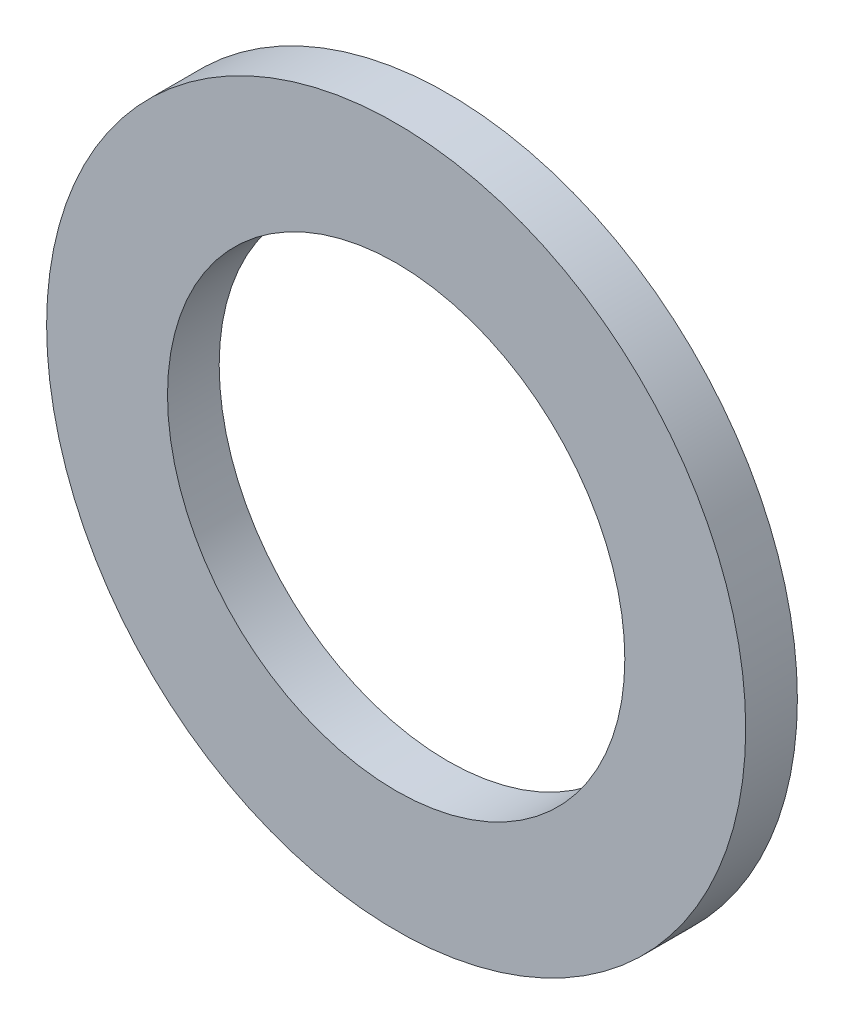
from build123d import *

# Parameters (mm, degrees)
SKETCH1_R           = 10.308984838
SKETCH1_R_2         = 6.7437
BOSS_EXTRUDE1_DEPTH = 1.524


with BuildPart() as part:
    # Sketch1 → Boss-Extrude1 (new body)
    with BuildSketch(Plane.XY):
        with Locations(Location((9.468478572, -4.905028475, 0), (0, 0, 180))):
            Circle(SKETCH1_R)
        with Locations(Location((9.468478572, -4.905028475, 0), (0, 0, 180))):
            Circle(SKETCH1_R_2, mode=Mode.SUBTRACT)
    extrude(amount=BOSS_EXTRUDE1_DEPTH)


solid = part.part
